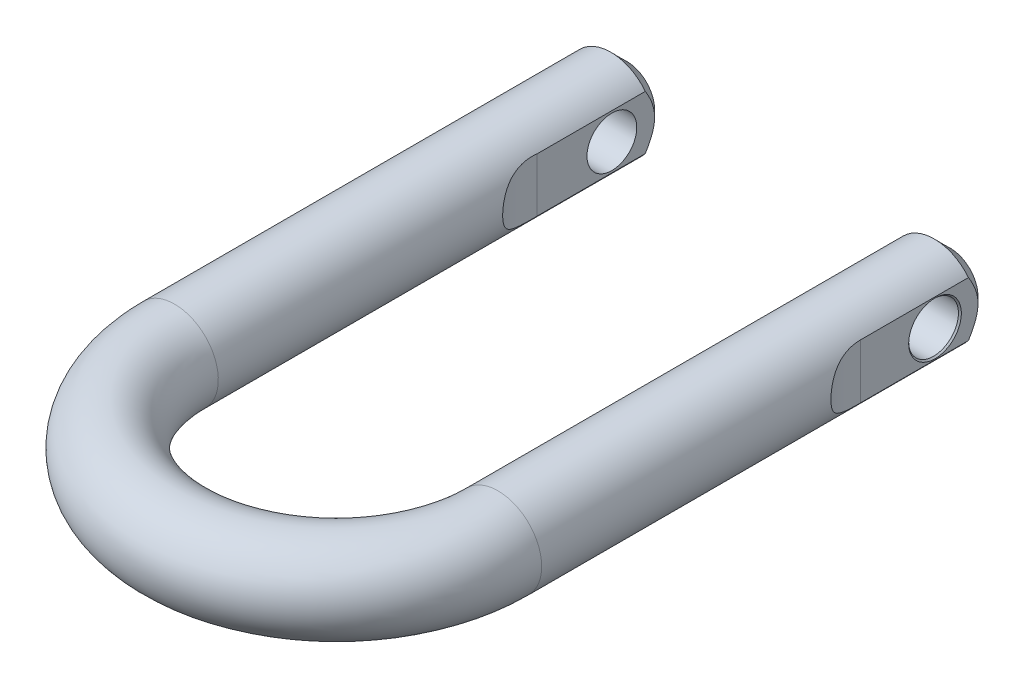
ISO-10303-21;
HEADER;
FILE_DESCRIPTION(('STEP AP214'),'2;1');
FILE_NAME('part.step','',(''),(''),'','','');
FILE_SCHEMA(('AUTOMOTIVE_DESIGN { 1 0 10303 214 1 1 1 1 }'));
ENDSEC;
DATA;
#1=APPLICATION_CONTEXT('core data for automotive mechanical design processes');
#2=APPLICATION_PROTOCOL_DEFINITION('international standard','automotive_design',2000,#1);
#3=PRODUCT_CONTEXT('',#1,'mechanical');
#4=PRODUCT('Part','Part','',(#3));
#5=PRODUCT_RELATED_PRODUCT_CATEGORY('part','',(#4));
#6=PRODUCT_DEFINITION_FORMATION('','',#4);
#7=PRODUCT_DEFINITION_CONTEXT('part definition',#1,'design');
#8=PRODUCT_DEFINITION('design','',#6,#7);
#9=PRODUCT_DEFINITION_SHAPE('','',#8);
#10=(LENGTH_UNIT() NAMED_UNIT(*) SI_UNIT(.MILLI.,.METRE.));
#11=(NAMED_UNIT(*) PLANE_ANGLE_UNIT() SI_UNIT($,.RADIAN.));
#12=(NAMED_UNIT(*) SI_UNIT($,.STERADIAN.) SOLID_ANGLE_UNIT());
#13=UNCERTAINTY_MEASURE_WITH_UNIT(LENGTH_MEASURE(1.E-05),#10,'distance_accuracy_value','');
#14=(GEOMETRIC_REPRESENTATION_CONTEXT(3) GLOBAL_UNCERTAINTY_ASSIGNED_CONTEXT((#13)) GLOBAL_UNIT_ASSIGNED_CONTEXT((#10,
#11,#12)) REPRESENTATION_CONTEXT('',''));
#15=CARTESIAN_POINT('',(0.,0.,0.));
#16=DIRECTION('',(0.,0.,1.));
#17=DIRECTION('',(1.,0.,0.));
#18=AXIS2_PLACEMENT_3D('',#15,#16,#17);
#19=CARTESIAN_POINT('',(59.0296,0.,0.));
#20=DIRECTION('',(1.,0.,0.));
#21=DIRECTION('',(0.,0.,1.));
#22=AXIS2_PLACEMENT_3D('',#19,#20,#21);
#23=CONICAL_SURFACE('',#22,7.9375,0.785398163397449);
#24=CARTESIAN_POINT('',(58.5921,0.,0.));
#25=DIRECTION('',(1.,0.,0.));
#26=DIRECTION('',(0.,0.,1.));
#27=AXIS2_PLACEMENT_3D('',#24,#25,#26);
#28=CIRCLE('',#27,7.5);
#29=CARTESIAN_POINT('',(58.5921,0.,7.49999999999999));
#30=VERTEX_POINT('',#29);
#31=EDGE_CURVE('E139',#30,#30,#28,.F.);
#32=ORIENTED_EDGE('',*,*,#31,.T.);
#33=EDGE_LOOP('',(#32));
#34=FACE_BOUND('',#33,.T.);
#35=CARTESIAN_POINT('',(59.0296,0.,0.));
#36=DIRECTION('',(1.,0.,0.));
#37=DIRECTION('',(0.,0.,1.));
#38=AXIS2_PLACEMENT_3D('',#35,#36,#37);
#39=CIRCLE('',#38,7.9375);
#40=CARTESIAN_POINT('',(59.0296,0.,7.93749999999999));
#41=VERTEX_POINT('',#40);
#42=EDGE_CURVE('E138',#41,#41,#39,.T.);
#43=ORIENTED_EDGE('',*,*,#42,.T.);
#44=EDGE_LOOP('',(#43));
#45=FACE_BOUND('',#44,.T.);
#46=ADVANCED_FACE('F14',(#34,#45),#23,.F.);
#47=CARTESIAN_POINT('',(48.7426,0.,-14.83995));
#48=DIRECTION('',(0.,0.,1.));
#49=DIRECTION('',(0.,-1.,0.));
#50=AXIS2_PLACEMENT_3D('',#47,#48,#49);
#51=PLANE('',#50);
#52=CARTESIAN_POINT('',(48.7426,0.,-14.83995));
#53=DIRECTION('',(0.,0.,1.));
#54=DIRECTION('',(-1.,0.,0.));
#55=AXIS2_PLACEMENT_3D('',#52,#53,#54);
#56=CIRCLE('',#55,8.4074);
#57=CARTESIAN_POINT('',(40.3352,0.,-14.83995));
#58=VERTEX_POINT('',#57);
#59=EDGE_CURVE('E136',#58,#58,#56,.T.);
#60=ORIENTED_EDGE('',*,*,#59,.F.);
#61=EDGE_LOOP('',(#60));
#62=FACE_BOUND('',#61,.T.);
#63=ADVANCED_FACE('F240',(#62),#51,.F.);
#64=CARTESIAN_POINT('',(-48.7426,0.,-14.83995));
#65=DIRECTION('',(0.,0.,-1.));
#66=DIRECTION('',(1.,0.,0.));
#67=AXIS2_PLACEMENT_3D('',#64,#65,#66);
#68=PLANE('',#67);
#69=CARTESIAN_POINT('',(-48.7426,0.,-14.83995));
#70=DIRECTION('',(0.,0.,1.));
#71=DIRECTION('',(-1.,0.,0.));
#72=AXIS2_PLACEMENT_3D('',#69,#70,#71);
#73=CIRCLE('',#72,8.4074);
#74=CARTESIAN_POINT('',(-57.15,0.,-14.83995));
#75=VERTEX_POINT('',#74);
#76=EDGE_CURVE('E438',#75,#75,#73,.T.);
#77=ORIENTED_EDGE('',*,*,#76,.F.);
#78=EDGE_LOOP('',(#77));
#79=FACE_BOUND('',#78,.T.);
#80=ADVANCED_FACE('F237',(#79),#68,.T.);
#81=CARTESIAN_POINT('',(-59.0296,0.,0.));
#82=DIRECTION('',(-1.,0.,0.));
#83=DIRECTION('',(0.,0.,-1.));
#84=AXIS2_PLACEMENT_3D('',#81,#82,#83);
#85=CONICAL_SURFACE('',#84,7.9375,0.785398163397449);
#86=CARTESIAN_POINT('',(-58.5921,0.,0.));
#87=DIRECTION('',(-1.,0.,0.));
#88=DIRECTION('',(0.,0.,-1.));
#89=AXIS2_PLACEMENT_3D('',#86,#87,#88);
#90=CIRCLE('',#89,7.5);
#91=CARTESIAN_POINT('',(-58.5921,0.,-7.49999999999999));
#92=VERTEX_POINT('',#91);
#93=EDGE_CURVE('E271',#92,#92,#90,.F.);
#94=ORIENTED_EDGE('',*,*,#93,.T.);
#95=EDGE_LOOP('',(#94));
#96=FACE_BOUND('',#95,.T.);
#97=CARTESIAN_POINT('',(-59.0296,0.,0.));
#98=DIRECTION('',(-1.,0.,0.));
#99=DIRECTION('',(0.,0.,-1.));
#100=AXIS2_PLACEMENT_3D('',#97,#98,#99);
#101=CIRCLE('',#100,7.9375);
#102=CARTESIAN_POINT('',(-59.0296,0.,-7.93749999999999));
#103=VERTEX_POINT('',#102);
#104=EDGE_CURVE('E116',#103,#103,#101,.T.);
#105=ORIENTED_EDGE('',*,*,#104,.T.);
#106=EDGE_LOOP('',(#105));
#107=FACE_BOUND('',#106,.T.);
#108=ADVANCED_FACE('F233',(#96,#107),#85,.F.);
#109=CARTESIAN_POINT('',(84.4296,25.4,22.49805));
#110=DIRECTION('',(0.,-1.,0.));
#111=DIRECTION('',(1.,0.,0.));
#112=AXIS2_PLACEMENT_3D('',#109,#110,#111);
#113=CYLINDRICAL_SURFACE('',#112,25.4);
#114=DIRECTION('',(0.,-1.,0.));
#115=VECTOR('',#114,1.);
#116=CARTESIAN_POINT('',(59.0296,25.4,22.49805));
#117=LINE('',#116,#115);
#118=CARTESIAN_POINT('',(59.0296,-8.22337503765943,22.49805));
#119=VERTEX_POINT('',#118);
#120=CARTESIAN_POINT('',(59.0296,8.22337503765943,22.49805));
#121=VERTEX_POINT('',#120);
#122=EDGE_CURVE('E137',#119,#121,#117,.F.);
#123=ORIENTED_EDGE('',*,*,#122,.T.);
#124=CARTESIAN_POINT('',(59.0296,-8.22337503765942,22.49805));
#125=CARTESIAN_POINT('',(59.0295964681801,-8.22336756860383,22.7016537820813));
#126=CARTESIAN_POINT('',(59.0320480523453,-8.22031233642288,22.9052572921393));
#127=CARTESIAN_POINT('',(59.0418354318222,-8.20805265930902,23.3121642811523));
#128=CARTESIAN_POINT('',(59.0491712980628,-8.1988481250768,23.5154677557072));
#129=CARTESIAN_POINT('',(59.0687103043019,-8.17422470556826,23.9216581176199));
#130=CARTESIAN_POINT('',(59.0809179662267,-8.15880004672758,24.124544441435));
#131=CARTESIAN_POINT('',(59.1101429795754,-8.12162950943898,24.5293807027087));
#132=CARTESIAN_POINT('',(59.1271604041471,-8.09988353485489,24.7313306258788));
#133=CARTESIAN_POINT('',(59.185664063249,-8.02451646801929,25.338831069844));
#134=CARTESIAN_POINT('',(59.2344321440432,-7.96097243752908,25.7425280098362));
#135=CARTESIAN_POINT('',(59.3502878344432,-7.80593343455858,26.5416896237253));
#136=CARTESIAN_POINT('',(59.4173674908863,-7.71445059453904,26.9371577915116));
#137=CARTESIAN_POINT('',(59.5523510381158,-7.52370289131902,27.6342553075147));
#138=CARTESIAN_POINT('',(59.6170905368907,-7.43015935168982,27.938067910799));
#139=CARTESIAN_POINT('',(59.7559004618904,-7.22281540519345,28.5364953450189));
#140=CARTESIAN_POINT('',(59.8299689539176,-7.10901919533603,28.8311120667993));
#141=CARTESIAN_POINT('',(59.9857406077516,-6.8599967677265,29.4079500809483));
#142=CARTESIAN_POINT('',(60.0674194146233,-6.72483801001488,29.6902069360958));
#143=CARTESIAN_POINT('',(60.2366804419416,-6.43125842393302,30.2404921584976));
#144=CARTESIAN_POINT('',(60.3242607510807,-6.27284510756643,30.5085250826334));
#145=CARTESIAN_POINT('',(60.4794557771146,-5.97600882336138,30.9592355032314));
#146=CARTESIAN_POINT('',(60.5462963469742,-5.84320614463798,31.1458915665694));
#147=CARTESIAN_POINT('',(60.6806054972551,-5.56366273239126,31.5081860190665));
#148=CARTESIAN_POINT('',(60.748073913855,-5.41692554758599,31.6838271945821));
#149=CARTESIAN_POINT('',(60.8822022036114,-5.10924960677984,32.0223970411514));
#150=CARTESIAN_POINT('',(60.948862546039,-4.94831959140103,32.1853334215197));
#151=CARTESIAN_POINT('',(61.079774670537,-4.61226373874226,32.4967613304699));
#152=CARTESIAN_POINT('',(61.1440268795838,-4.43714043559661,32.6452554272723));
#153=CARTESIAN_POINT('',(61.3081708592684,-3.9562433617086,33.0157817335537));
#154=CARTESIAN_POINT('',(61.404632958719,-3.63842599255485,33.2242520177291));
#155=CARTESIAN_POINT('',(61.5346338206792,-3.13689898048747,33.4976323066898));
#156=CARTESIAN_POINT('',(61.5755306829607,-2.96552429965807,33.5822280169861));
#157=CARTESIAN_POINT('',(61.651448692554,-2.61532318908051,33.7374120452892));
#158=CARTESIAN_POINT('',(61.686472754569,-2.43650051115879,33.8080073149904));
#159=CARTESIAN_POINT('',(61.7492534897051,-2.07517973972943,33.9333786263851));
#160=CARTESIAN_POINT('',(61.7771093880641,-1.89277426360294,33.9883718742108));
#161=CARTESIAN_POINT('',(61.8254585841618,-1.52309374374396,34.0831968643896));
#162=CARTESIAN_POINT('',(61.8459519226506,-1.33581872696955,34.1230286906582));
#163=CARTESIAN_POINT('',(61.87898110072,-0.957971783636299,34.1869715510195));
#164=CARTESIAN_POINT('',(61.8915196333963,-0.767400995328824,34.211087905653));
#165=CARTESIAN_POINT('',(61.9082784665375,-0.384549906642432,34.2432793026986));
#166=CARTESIAN_POINT('',(61.9124993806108,-0.192269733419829,34.2513555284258));
#167=CARTESIAN_POINT('',(61.9125005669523,0.17599235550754,34.2513568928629));
#168=CARTESIAN_POINT('',(61.908965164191,0.351975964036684,34.2445914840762));
#169=CARTESIAN_POINT('',(61.8949139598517,0.702629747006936,34.2176130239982));
#170=CARTESIAN_POINT('',(61.8843981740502,0.877299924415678,34.1974000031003));
#171=CARTESIAN_POINT('',(61.8566482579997,1.22403112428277,34.1437683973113));
#172=CARTESIAN_POINT('',(61.8394149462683,1.39609246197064,34.1103514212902));
#173=CARTESIAN_POINT('',(61.7986475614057,1.73645389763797,34.0306988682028));
#174=CARTESIAN_POINT('',(61.7751133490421,1.90475391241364,33.9844630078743));
#175=CARTESIAN_POINT('',(61.7223863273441,2.23593806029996,33.8798713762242));
#176=CARTESIAN_POINT('',(61.6932145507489,2.39883976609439,33.821560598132));
#177=CARTESIAN_POINT('',(61.6298007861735,2.71900769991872,33.693329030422));
#178=CARTESIAN_POINT('',(61.5955570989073,2.87627201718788,33.6234043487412));
#179=CARTESIAN_POINT('',(61.4862805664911,3.33838864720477,33.397229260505));
#180=CARTESIAN_POINT('',(61.4046644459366,3.63379258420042,33.2245047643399));
#181=CARTESIAN_POINT('',(61.2211907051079,4.22327185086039,32.8219692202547));
#182=CARTESIAN_POINT('',(61.1181209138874,4.51419394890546,32.5881523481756));
#183=CARTESIAN_POINT('',(60.9057951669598,5.05850041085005,32.0827076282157));
#184=CARTESIAN_POINT('',(60.7965357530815,5.31186349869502,31.8110585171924));
#185=CARTESIAN_POINT('',(60.6031548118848,5.72831891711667,31.3024271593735));
#186=CARTESIAN_POINT('',(60.5189331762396,5.89887114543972,31.0714868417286));
#187=CARTESIAN_POINT('',(60.3531804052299,6.2187745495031,30.594332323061));
#188=CARTESIAN_POINT('',(60.2716504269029,6.36811669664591,30.3481116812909));
#189=CARTESIAN_POINT('',(60.1131665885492,6.64697472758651,29.8425332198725));
#190=CARTESIAN_POINT('',(60.0362239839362,6.77644298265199,29.5831457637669));
#191=CARTESIAN_POINT('',(59.8887294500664,7.01640044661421,29.0540507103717));
#192=CARTESIAN_POINT('',(59.8181773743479,7.12689009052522,28.784343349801));
#193=CARTESIAN_POINT('',(59.6625786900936,7.36387427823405,28.1456552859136));
#194=CARTESIAN_POINT('',(59.5804816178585,7.48353010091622,27.7734075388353));
#195=CARTESIAN_POINT('',(59.431986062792,7.69414462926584,27.0177563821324));
#196=CARTESIAN_POINT('',(59.3655943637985,7.78509093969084,26.6343482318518));
#197=CARTESIAN_POINT('',(59.2500353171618,7.94036630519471,25.8599943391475));
#198=CARTESIAN_POINT('',(59.2008544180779,8.00471630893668,25.4690547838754));
#199=CARTESIAN_POINT('',(59.1205977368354,8.1084975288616,24.682240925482));
#200=CARTESIAN_POINT('',(59.0895128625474,8.14794125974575,24.286369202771));
#201=CARTESIAN_POINT('',(59.0550240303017,8.1914933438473,23.6576739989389));
#202=CARTESIAN_POINT('',(59.0454825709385,8.20347754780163,23.4256854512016));
#203=CARTESIAN_POINT('',(59.0327762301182,8.21940263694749,22.9618207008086));
#204=CARTESIAN_POINT('',(59.029595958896,8.22336293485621,22.7299455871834));
#205=CARTESIAN_POINT('',(59.0296,8.22337503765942,22.49805));
#206=B_SPLINE_CURVE_WITH_KNOTS('',3,(#124,#125,#126,#127,#128,#129,#130,#131,#132,#133,#134,
#135,#136,#137,#138,#139,#140,#141,#142,#143,#144,#145,#146,#147,#148,#149,#150,#151,#152,#153,
#154,#155,#156,#157,#158,#159,#160,#161,#162,#163,#164,#165,#166,#167,#168,#169,#170,#171,#172,
#173,#174,#175,#176,#177,#178,#179,#180,#181,#182,#183,#184,#185,#186,#187,#188,#189,#190,#191,
#192,#193,#194,#195,#196,#197,#198,#199,#200,#201,#202,#203,#204,#205),.UNSPECIFIED.,.F.,.F.,(4,
2,2,2,2,2,2,2,2,2,2,2,2,2,2,2,2,2,2,2,2,2,2,2,2,2,2,2,2,2,2,2,2,2,2,2,2,2,2,2,4),(0.,
0.61077262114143,1.22155411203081,1.83290384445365,2.44426287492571,3.67749443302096,
4.91019121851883,5.8826187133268,6.85484492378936,7.82406015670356,8.79296298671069,
9.50826502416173,10.2233853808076,10.9380683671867,11.6526240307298,12.8232855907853,
13.4090341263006,13.9944910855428,14.5713453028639,15.1481963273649,15.7248519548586,
16.301465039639,16.8292625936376,17.3570589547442,17.8847910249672,18.4125347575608,
18.9383463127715,19.4643344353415,20.5155915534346,21.6731225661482,22.8313068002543,
23.7277165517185,24.6245067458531,25.5234136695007,26.4222999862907,27.6192046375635,
28.8166253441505,30.0131010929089,31.2089751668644,31.9062534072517,32.6018426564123),.UNSPECIFIED.);
#207=EDGE_CURVE('E181',#119,#121,#206,.T.);
#208=ORIENTED_EDGE('',*,*,#207,.F.);
#209=EDGE_LOOP('',(#123,#208));
#210=FACE_BOUND('',#209,.T.);
#211=ADVANCED_FACE('F228',(#210),#113,.F.);
#212=CARTESIAN_POINT('',(59.0296,25.4,-35.3090993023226));
#213=DIRECTION('',(-1.,0.,0.));
#214=DIRECTION('',(0.,0.,-1.));
#215=AXIS2_PLACEMENT_3D('',#212,#213,#214);
#216=PLANE('',#215);
#217=ORIENTED_EDGE('',*,*,#42,.F.);
#218=EDGE_LOOP('',(#217));
#219=FACE_BOUND('',#218,.T.);
#220=DIRECTION('',(0.,0.,-1.));
#221=VECTOR('',#220,1.);
#222=CARTESIAN_POINT('',(59.0296,-8.22337503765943,121.44375));
#223=LINE('',#222,#221);
#224=CARTESIAN_POINT('',(59.0296,-8.22337503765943,-10.07745));
#225=VERTEX_POINT('',#224);
#226=EDGE_CURVE('E105',#225,#119,#223,.F.);
#227=ORIENTED_EDGE('',*,*,#226,.F.);
#228=CARTESIAN_POINT('',(59.0296,8.22337503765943,-10.07745));
#229=CARTESIAN_POINT('',(59.0296,8.02526383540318,-10.2011338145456));
#230=CARTESIAN_POINT('',(59.0296,7.82593146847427,-10.3228883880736));
#231=CARTESIAN_POINT('',(59.0296,7.42454033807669,-10.5619235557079));
#232=CARTESIAN_POINT('',(59.0296,7.22248093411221,-10.679203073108));
#233=CARTESIAN_POINT('',(59.0296,6.81459284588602,-10.9090938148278));
#234=CARTESIAN_POINT('',(59.0296,6.60875190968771,-11.0216834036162));
#235=CARTESIAN_POINT('',(59.0296,6.19391827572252,-11.2408511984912));
#236=CARTESIAN_POINT('',(59.0296,5.98492577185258,-11.3474297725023));
#237=CARTESIAN_POINT('',(59.0296,5.34349051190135,-11.6614158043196));
#238=CARTESIAN_POINT('',(59.0296,4.90558714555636,-11.857905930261));
#239=CARTESIAN_POINT('',(59.0296,4.01485423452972,-12.2121703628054));
#240=CARTESIAN_POINT('',(59.0296,3.56205090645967,-12.3700089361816));
#241=CARTESIAN_POINT('',(59.0296,2.80100013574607,-12.5897266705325));
#242=CARTESIAN_POINT('',(59.0296,2.49689248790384,-12.6659160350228));
#243=CARTESIAN_POINT('',(59.0296,1.88345085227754,-12.7936494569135));
#244=CARTESIAN_POINT('',(59.0296,1.57411680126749,-12.8451932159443));
#245=CARTESIAN_POINT('',(59.0296,0.955218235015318,-12.9206138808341));
#246=CARTESIAN_POINT('',(59.0296,0.645687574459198,-12.9447648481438));
#247=CARTESIAN_POINT('',(59.0296,0.0257101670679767,-12.9649831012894));
#248=CARTESIAN_POINT('',(59.0296,-0.284736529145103,-12.9610519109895));
#249=CARTESIAN_POINT('',(59.0296,-0.903850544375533,-12.9253435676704));
#250=CARTESIAN_POINT('',(59.0296,-1.21251863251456,-12.8935795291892));
#251=CARTESIAN_POINT('',(59.0296,-1.82601712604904,-12.8039529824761));
#252=CARTESIAN_POINT('',(59.0296,-2.13084710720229,-12.7460876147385));
#253=CARTESIAN_POINT('',(59.0296,-2.73799233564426,-12.6063546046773));
#254=CARTESIAN_POINT('',(59.0296,-3.04025470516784,-12.5242601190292));
#255=CARTESIAN_POINT('',(59.0296,-3.63837827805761,-12.3395912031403));
#256=CARTESIAN_POINT('',(59.0296,-3.9342394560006,-12.2370166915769));
#257=CARTESIAN_POINT('',(59.0296,-4.580830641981,-11.9912817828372));
#258=CARTESIAN_POINT('',(59.0296,-4.93003148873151,-11.8441220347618));
#259=CARTESIAN_POINT('',(59.0296,-5.61931704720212,-11.529630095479));
#260=CARTESIAN_POINT('',(59.0296,-5.95939715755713,-11.3622879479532));
#261=CARTESIAN_POINT('',(59.0296,-6.62430275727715,-11.0152201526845));
#262=CARTESIAN_POINT('',(59.0296,-6.94929797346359,-10.8358176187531));
#263=CARTESIAN_POINT('',(59.0296,-7.43120304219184,-10.5576686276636));
#264=CARTESIAN_POINT('',(59.0296,-7.59079347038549,-10.463516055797));
#265=CARTESIAN_POINT('',(59.0296,-7.90830253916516,-10.2724678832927));
#266=CARTESIAN_POINT('',(59.0296,-8.06622135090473,-10.1755725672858));
#267=CARTESIAN_POINT('',(59.0296,-8.22337503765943,-10.07745));
#268=B_SPLINE_CURVE_WITH_KNOTS('',3,(#228,#229,#230,#231,#232,#233,#234,#235,#236,#237,#238,
#239,#240,#241,#242,#243,#244,#245,#246,#247,#248,#249,#250,#251,#252,#253,#254,#255,#256,#257,
#258,#259,#260,#261,#262,#263,#264,#265,#266,#267),.UNSPECIFIED.,.F.,.F.,(4,2,2,2,2,2,2,2,2,2,2,
2,2,2,2,2,2,2,2,4),(0.,0.700659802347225,1.40148713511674,2.10525296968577,2.80897568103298,
4.24749394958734,5.68360386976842,6.6232597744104,7.5629270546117,8.49310778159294,
9.42323803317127,10.3529302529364,11.2827243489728,12.2215157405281,13.1603108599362,
14.2963089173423,15.4328696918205,16.5461943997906,17.1020540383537,17.6578562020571),.UNSPECIFIED.);
#269=CARTESIAN_POINT('',(59.0296,8.22337503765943,-10.07745));
#270=VERTEX_POINT('',#269);
#271=EDGE_CURVE('E220',#270,#225,#268,.T.);
#272=ORIENTED_EDGE('',*,*,#271,.F.);
#273=DIRECTION('',(0.,0.,-1.));
#274=VECTOR('',#273,1.);
#275=CARTESIAN_POINT('',(59.0296,8.22337503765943,121.44375));
#276=LINE('',#275,#274);
#277=EDGE_CURVE('E131',#121,#270,#276,.T.);
#278=ORIENTED_EDGE('',*,*,#277,.F.);
#279=ORIENTED_EDGE('',*,*,#122,.F.);
#280=EDGE_LOOP('',(#227,#272,#278,#279));
#281=FACE_BOUND('',#280,.T.);
#282=ADVANCED_FACE('F225',(#219,#281),#216,.F.);
#283=CARTESIAN_POINT('',(48.7426,0.,-10.07745));
#284=DIRECTION('',(0.,0.,1.));
#285=DIRECTION('',(-1.,0.,0.));
#286=AXIS2_PLACEMENT_3D('',#283,#284,#285);
#287=CONICAL_SURFACE('',#286,13.1699,0.78539816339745);
#288=ORIENTED_EDGE('',*,*,#59,.T.);
#289=EDGE_LOOP('',(#288));
#290=FACE_BOUND('',#289,.T.);
#291=CARTESIAN_POINT('',(38.3794,-8.12713675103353,-10.07745));
#292=CARTESIAN_POINT('',(38.3794,-7.93111417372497,-10.1983981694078));
#293=CARTESIAN_POINT('',(38.3794,-7.73388385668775,-10.3174155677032));
#294=CARTESIAN_POINT('',(38.3794,-7.33673633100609,-10.5509844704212));
#295=CARTESIAN_POINT('',(38.3794,-7.13681849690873,-10.665534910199));
#296=CARTESIAN_POINT('',(38.3794,-6.73330326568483,-10.8899603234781));
#297=CARTESIAN_POINT('',(38.3794,-6.52969426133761,-10.9998145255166));
#298=CARTESIAN_POINT('',(38.3794,-6.11939103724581,-11.2135548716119));
#299=CARTESIAN_POINT('',(38.3794,-5.91269700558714,-11.3174413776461));
#300=CARTESIAN_POINT('',(38.3794,-5.27887907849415,-11.6230960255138));
#301=CARTESIAN_POINT('',(38.3794,-4.84644365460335,-11.8140857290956));
#302=CARTESIAN_POINT('',(38.3794,-3.96716928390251,-12.1581049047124));
#303=CARTESIAN_POINT('',(38.3794,-3.52035454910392,-12.3111947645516));
#304=CARTESIAN_POINT('',(38.3794,-2.76395291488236,-12.525823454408));
#305=CARTESIAN_POINT('',(38.3794,-2.45820837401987,-12.6008732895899));
#306=CARTESIAN_POINT('',(38.3794,-1.8415787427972,-12.7261195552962));
#307=CARTESIAN_POINT('',(38.3794,-1.53069360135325,-12.7763157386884));
#308=CARTESIAN_POINT('',(38.3794,-0.908724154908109,-12.8489231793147));
#309=CARTESIAN_POINT('',(38.3794,-0.597671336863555,-12.871600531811));
#310=CARTESIAN_POINT('',(38.3794,0.0252108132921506,-12.888795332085));
#311=CARTESIAN_POINT('',(38.3794,0.337040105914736,-12.8833141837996));
#312=CARTESIAN_POINT('',(38.3794,0.958694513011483,-12.8445231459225));
#313=CARTESIAN_POINT('',(38.3794,1.26852097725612,-12.8112345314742));
#314=CARTESIAN_POINT('',(38.3794,1.88423735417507,-12.718648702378));
#315=CARTESIAN_POINT('',(38.3794,2.19012683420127,-12.6593486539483));
#316=CARTESIAN_POINT('',(38.3794,2.79921745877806,-12.5168803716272));
#317=CARTESIAN_POINT('',(38.3794,3.10236739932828,-12.433495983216));
#318=CARTESIAN_POINT('',(38.3794,3.70224539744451,-12.2463830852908));
#319=CARTESIAN_POINT('',(38.3794,3.99897343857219,-12.1426545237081));
#320=CARTESIAN_POINT('',(38.3794,4.63110074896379,-11.9007632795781));
#321=CARTESIAN_POINT('',(38.3794,4.96540460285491,-11.7597571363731));
#322=CARTESIAN_POINT('',(38.3794,5.62568955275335,-11.4593132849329));
#323=CARTESIAN_POINT('',(38.3794,5.95166727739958,-11.2998682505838));
#324=CARTESIAN_POINT('',(38.3794,6.58975037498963,-10.9694156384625));
#325=CARTESIAN_POINT('',(38.3794,6.90200191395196,-10.7986886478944));
#326=CARTESIAN_POINT('',(38.3794,7.36522804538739,-10.5341091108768));
#327=CARTESIAN_POINT('',(38.3794,7.51868555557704,-10.444558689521));
#328=CARTESIAN_POINT('',(38.3794,7.82404597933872,-10.2628756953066));
#329=CARTESIAN_POINT('',(38.3794,7.9759490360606,-10.1707433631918));
#330=CARTESIAN_POINT('',(38.3794,8.12713675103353,-10.07745));
#331=B_SPLINE_CURVE_WITH_KNOTS('',3,(#291,#292,#293,#294,#295,#296,#297,#298,#299,#300,#301,
#302,#303,#304,#305,#306,#307,#308,#309,#310,#311,#312,#313,#314,#315,#316,#317,#318,#319,#320,
#321,#322,#323,#324,#325,#326,#327,#328,#329,#330),.UNSPECIFIED.,.F.,.F.,(4,2,2,2,2,2,2,2,2,2,2,
2,2,2,2,2,2,2,2,4),(0.,0.691007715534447,1.38217913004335,2.07614447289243,2.77006767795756,
4.18691184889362,5.601483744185,6.54507035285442,7.48866634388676,8.42306354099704,
9.35741415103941,10.2910505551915,11.2247886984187,12.1671822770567,13.1095782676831,
14.1973456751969,15.2855467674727,16.3528661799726,16.8858715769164,17.4188274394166),.UNSPECIFIED.);
#332=CARTESIAN_POINT('',(38.3794,-8.12713675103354,-10.07745));
#333=VERTEX_POINT('',#332);
#334=CARTESIAN_POINT('',(38.3794,8.12713675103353,-10.07745));
#335=VERTEX_POINT('',#334);
#336=EDGE_CURVE('E124',#333,#335,#331,.T.);
#337=ORIENTED_EDGE('',*,*,#336,.T.);
#338=CARTESIAN_POINT('',(48.7426,0.,-10.07745));
#339=DIRECTION('',(0.,0.,-1.));
#340=DIRECTION('',(1.,0.,0.));
#341=AXIS2_PLACEMENT_3D('',#338,#339,#340);
#342=CIRCLE('',#341,13.1699);
#343=EDGE_CURVE('E127',#270,#335,#342,.F.);
#344=ORIENTED_EDGE('',*,*,#343,.F.);
#345=ORIENTED_EDGE('',*,*,#271,.T.);
#346=CARTESIAN_POINT('',(48.7426,0.,-10.07745));
#347=DIRECTION('',(0.,0.,-1.));
#348=DIRECTION('',(1.,0.,0.));
#349=AXIS2_PLACEMENT_3D('',#346,#347,#348);
#350=CIRCLE('',#349,13.1699);
#351=EDGE_CURVE('E102',#333,#225,#350,.F.);
#352=ORIENTED_EDGE('',*,*,#351,.F.);
#353=EDGE_LOOP('',(#337,#344,#345,#352));
#354=FACE_BOUND('',#353,.T.);
#355=ADVANCED_FACE('F202',(#290,#354),#287,.T.);
#356=CARTESIAN_POINT('',(38.3794,25.4,-35.6582064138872));
#357=DIRECTION('',(1.,0.,0.));
#358=DIRECTION('',(0.,1.,0.));
#359=AXIS2_PLACEMENT_3D('',#356,#357,#358);
#360=PLANE('',#359);
#361=CARTESIAN_POINT('',(38.3794,0.,0.));
#362=DIRECTION('',(1.,0.,0.));
#363=DIRECTION('',(0.,1.,0.));
#364=AXIS2_PLACEMENT_3D('',#361,#362,#363);
#365=CIRCLE('',#364,7.5);
#366=CARTESIAN_POINT('',(38.3794,7.5,0.));
#367=VERTEX_POINT('',#366);
#368=EDGE_CURVE('E272',#367,#367,#365,.T.);
#369=ORIENTED_EDGE('',*,*,#368,.T.);
#370=EDGE_LOOP('',(#369));
#371=FACE_BOUND('',#370,.T.);
#372=DIRECTION('',(0.,0.,-1.));
#373=VECTOR('',#372,1.);
#374=CARTESIAN_POINT('',(38.3794,-8.12713675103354,121.44375));
#375=LINE('',#374,#373);
#376=CARTESIAN_POINT('',(38.3794,-8.12713675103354,22.49805));
#377=VERTEX_POINT('',#376);
#378=EDGE_CURVE('E120',#377,#333,#375,.T.);
#379=ORIENTED_EDGE('',*,*,#378,.F.);
#380=DIRECTION('',(0.,1.,0.));
#381=VECTOR('',#380,1.);
#382=CARTESIAN_POINT('',(38.3794,25.4,22.49805));
#383=LINE('',#382,#381);
#384=CARTESIAN_POINT('',(38.3794,8.12713675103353,22.49805));
#385=VERTEX_POINT('',#384);
#386=EDGE_CURVE('E134',#385,#377,#383,.F.);
#387=ORIENTED_EDGE('',*,*,#386,.F.);
#388=DIRECTION('',(0.,0.,-1.));
#389=VECTOR('',#388,1.);
#390=CARTESIAN_POINT('',(38.3794,8.12713675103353,121.44375));
#391=LINE('',#390,#389);
#392=EDGE_CURVE('E130',#335,#385,#391,.F.);
#393=ORIENTED_EDGE('',*,*,#392,.F.);
#394=ORIENTED_EDGE('',*,*,#336,.F.);
#395=EDGE_LOOP('',(#379,#387,#393,#394));
#396=FACE_BOUND('',#395,.T.);
#397=ADVANCED_FACE('F197',(#371,#396),#360,.F.);
#398=CARTESIAN_POINT('',(13.0251612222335,25.4,24.02205));
#399=DIRECTION('',(0.,-1.,0.));
#400=DIRECTION('',(1.,0.,0.));
#401=AXIS2_PLACEMENT_3D('',#398,#399,#400);
#402=CYLINDRICAL_SURFACE('',#401,25.4);
#403=CARTESIAN_POINT('',(38.3794,8.12713675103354,22.49805));
#404=CARTESIAN_POINT('',(38.3946115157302,8.14650683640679,22.7510065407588));
#405=CARTESIAN_POINT('',(38.4060443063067,8.16100064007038,23.0045356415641));
#406=CARTESIAN_POINT('',(38.4213274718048,8.18033338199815,23.5127176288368));
#407=CARTESIAN_POINT('',(38.4251620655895,8.18515222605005,23.7673717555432));
#408=CARTESIAN_POINT('',(38.4251598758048,8.18515319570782,24.4286471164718));
#409=CARTESIAN_POINT('',(38.415382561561,8.17287221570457,24.8353057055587));
#410=CARTESIAN_POINT('',(38.3764249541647,8.12340255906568,25.6463530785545));
#411=CARTESIAN_POINT('',(38.3472351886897,8.08620172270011,26.0507406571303));
#412=CARTESIAN_POINT('',(38.2699269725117,7.9858255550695,26.8549147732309));
#413=CARTESIAN_POINT('',(38.22178875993,7.92262310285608,27.2546960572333));
#414=CARTESIAN_POINT('',(38.1075412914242,7.76859197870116,28.0462210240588));
#415=CARTESIAN_POINT('',(38.0414382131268,7.67777280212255,28.4379674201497));
#416=CARTESIAN_POINT('',(37.9082257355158,7.48819255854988,29.1299097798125));
#417=CARTESIAN_POINT('',(37.8441749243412,7.39499558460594,29.4322262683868));
#418=CARTESIAN_POINT('',(37.7068230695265,7.18841438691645,30.0277889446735));
#419=CARTESIAN_POINT('',(37.6335218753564,7.0750298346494,30.3210349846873));
#420=CARTESIAN_POINT('',(37.4792507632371,6.82675271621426,30.8956115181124));
#421=CARTESIAN_POINT('',(37.3982939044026,6.6918965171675,31.1769611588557));
#422=CARTESIAN_POINT('',(37.2305220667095,6.39896950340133,31.7254687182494));
#423=CARTESIAN_POINT('',(37.1437089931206,6.24090621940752,31.9926312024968));
#424=CARTESIAN_POINT('',(36.9899571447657,5.94488474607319,32.4416228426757));
#425=CARTESIAN_POINT('',(36.9237874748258,5.81255065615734,32.6274339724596));
#426=CARTESIAN_POINT('',(36.7908304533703,5.53401234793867,32.9880898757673));
#427=CARTESIAN_POINT('',(36.7240432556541,5.38781150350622,33.1629372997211));
#428=CARTESIAN_POINT('',(36.5912879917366,5.08131016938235,33.4999420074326));
#429=CARTESIAN_POINT('',(36.5253193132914,4.92102104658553,33.6621093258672));
#430=CARTESIAN_POINT('',(36.3957729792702,4.5863275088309,33.9720630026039));
#431=CARTESIAN_POINT('',(36.3321948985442,4.41192562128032,34.1198519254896));
#432=CARTESIAN_POINT('',(36.1697895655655,3.93305270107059,34.4885976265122));
#433=CARTESIAN_POINT('',(36.0743634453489,3.61660902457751,34.6960511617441));
#434=CARTESIAN_POINT('',(35.945786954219,3.11729853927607,34.9680573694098));
#435=CARTESIAN_POINT('',(35.9053437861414,2.94669101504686,35.0522193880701));
#436=CARTESIAN_POINT('',(35.8302801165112,2.5980718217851,35.2065881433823));
#437=CARTESIAN_POINT('',(35.7956567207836,2.42006388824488,35.2768018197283));
#438=CARTESIAN_POINT('',(35.7336759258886,2.06078682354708,35.401335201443));
#439=CARTESIAN_POINT('',(35.706206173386,1.87962280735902,35.4559022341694));
#440=CARTESIAN_POINT('',(35.6585285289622,1.5124792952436,35.549993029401));
#441=CARTESIAN_POINT('',(35.638320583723,1.32649983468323,35.589516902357));
#442=CARTESIAN_POINT('',(35.6057514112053,0.951276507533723,35.652966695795));
#443=CARTESIAN_POINT('',(35.5933877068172,0.762033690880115,35.6768975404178));
#444=CARTESIAN_POINT('',(35.5768625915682,0.381857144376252,35.7088414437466));
#445=CARTESIAN_POINT('',(35.5727005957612,0.190923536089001,35.7168556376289));
#446=CARTESIAN_POINT('',(35.5726994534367,-0.175157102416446,35.716856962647));
#447=CARTESIAN_POINT('',(35.5762013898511,-0.350305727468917,35.7101129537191));
#448=CARTESIAN_POINT('',(35.5901194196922,-0.699295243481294,35.6832202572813));
#449=CARTESIAN_POINT('',(35.6005355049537,-0.873136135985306,35.6630715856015));
#450=CARTESIAN_POINT('',(35.6280216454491,-1.2182199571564,35.6096122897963));
#451=CARTESIAN_POINT('',(35.6450908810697,-1.38946320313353,35.5763032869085));
#452=CARTESIAN_POINT('',(35.6854688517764,-1.72820524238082,35.4969111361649));
#453=CARTESIAN_POINT('',(35.7087777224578,-1.8957039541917,35.4508277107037));
#454=CARTESIAN_POINT('',(35.7609975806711,-2.22530833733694,35.3465863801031));
#455=CARTESIAN_POINT('',(35.7898876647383,-2.38743156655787,35.2884734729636));
#456=CARTESIAN_POINT('',(35.8526865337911,-2.70606975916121,35.1606835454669));
#457=CARTESIAN_POINT('',(35.8865970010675,-2.86258282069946,35.0910026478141));
#458=CARTESIAN_POINT('',(35.9948056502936,-3.32249437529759,34.8656281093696));
#459=CARTESIAN_POINT('',(36.075618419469,-3.61649146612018,34.6935300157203));
#460=CARTESIAN_POINT('',(36.2572966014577,-4.20326293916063,34.2924429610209));
#461=CARTESIAN_POINT('',(36.3593644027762,-4.49289106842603,34.0594549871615));
#462=CARTESIAN_POINT('',(36.5696084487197,-5.03479345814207,33.5558518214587));
#463=CARTESIAN_POINT('',(36.6777880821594,-5.28704670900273,33.2852156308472));
#464=CARTESIAN_POINT('',(36.8692920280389,-5.7018046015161,32.7783918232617));
#465=CARTESIAN_POINT('',(36.9527187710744,-5.87171892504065,32.5482033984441));
#466=CARTESIAN_POINT('',(37.1168933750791,-6.19042472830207,32.0726217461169));
#467=CARTESIAN_POINT('',(37.1976400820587,-6.33920719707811,31.8272220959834));
#468=CARTESIAN_POINT('',(37.354589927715,-6.61702495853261,31.3233322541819));
#469=CARTESIAN_POINT('',(37.4307815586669,-6.74601142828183,31.0648117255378));
#470=CARTESIAN_POINT('',(37.5768159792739,-6.98506469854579,30.5375040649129));
#471=CARTESIAN_POINT('',(37.6466589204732,-7.09513195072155,30.2687171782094));
#472=CARTESIAN_POINT('',(37.8006631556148,-7.33118620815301,29.63223830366));
#473=CARTESIAN_POINT('',(37.8818954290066,-7.45035443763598,29.2612977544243));
#474=CARTESIAN_POINT('',(38.0287733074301,-7.66006133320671,28.5083288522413));
#475=CARTESIAN_POINT('',(38.0944121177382,-7.75058752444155,28.1262957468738));
#476=CARTESIAN_POINT('',(38.2085655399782,-7.90503513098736,27.354916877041));
#477=CARTESIAN_POINT('',(38.2571010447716,-7.96898902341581,26.9655806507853));
#478=CARTESIAN_POINT('',(38.3362150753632,-8.07202877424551,26.1820270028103));
#479=CARTESIAN_POINT('',(38.3668029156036,-8.11112753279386,25.7878122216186));
#480=CARTESIAN_POINT('',(38.4004872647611,-8.15397531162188,25.1644185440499));
#481=CARTESIAN_POINT('',(38.4097405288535,-8.16568274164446,24.9360688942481));
#482=CARTESIAN_POINT('',(38.4220745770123,-8.18126671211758,24.4791631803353));
#483=CARTESIAN_POINT('',(38.4251617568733,-8.18515136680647,24.2506075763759));
#484=CARTESIAN_POINT('',(38.4251606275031,-8.18515397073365,23.7678037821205));
#485=CARTESIAN_POINT('',(38.4213392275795,-8.18034991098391,23.5135551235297));
#486=CARTESIAN_POINT('',(38.4060823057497,-8.16104698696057,23.0053535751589));
#487=CARTESIAN_POINT('',(38.3946377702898,-8.14653664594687,22.7514013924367));
#488=CARTESIAN_POINT('',(38.3794,-8.12713675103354,22.49805));
#489=B_SPLINE_CURVE_WITH_KNOTS('',3,(#403,#404,#405,#406,#407,#408,#409,#410,#411,#412,#413,
#414,#415,#416,#417,#418,#419,#420,#421,#422,#423,#424,#425,#426,#427,#428,#429,#430,#431,#432,
#433,#434,#435,#436,#437,#438,#439,#440,#441,#442,#443,#444,#445,#446,#447,#448,#449,#450,#451,
#452,#453,#454,#455,#456,#457,#458,#459,#460,#461,#462,#463,#464,#465,#466,#467,#468,#469,#470,
#471,#472,#473,#474,#475,#476,#477,#478,#479,#480,#481,#482,#483,#484,#485,#486,#487,#488),
.UNSPECIFIED.,.F.,.F.,(4,2,2,2,2,2,2,2,2,2,2,2,2,2,2,2,2,2,2,2,2,2,2,2,2,2,2,2,2,2,2,2,2,2,2,2,
2,2,2,2,2,2,4),(0.,0.76232888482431,1.52623944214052,2.74583254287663,3.96602118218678,
5.18748577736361,6.40853087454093,7.37605348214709,8.34359183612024,9.30950854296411,
10.2751124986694,10.9870897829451,11.6988942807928,12.4101296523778,13.1212379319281,
14.2862041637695,14.8690901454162,15.4516853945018,16.0244876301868,16.5972856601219,
17.1699027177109,17.7424789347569,18.2677719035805,18.7930642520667,19.3182919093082,
19.8435309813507,20.3668397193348,20.8903242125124,21.9365794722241,23.0889147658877,
24.241895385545,25.1348074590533,26.0280991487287,26.923559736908,27.8189989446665,
29.011286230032,30.2040920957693,31.3954357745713,32.5861606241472,33.2724821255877,
33.9580913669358,34.7207593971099,35.4843308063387),.UNSPECIFIED.);
#490=EDGE_CURVE('E66',#385,#377,#489,.T.);
#491=ORIENTED_EDGE('',*,*,#490,.F.);
#492=ORIENTED_EDGE('',*,*,#386,.T.);
#493=EDGE_LOOP('',(#491,#492));
#494=FACE_BOUND('',#493,.T.);
#495=ADVANCED_FACE('F192',(#494),#402,.F.);
#496=CARTESIAN_POINT('',(-84.4296,25.4,22.49805));
#497=DIRECTION('',(0.,-1.,0.));
#498=DIRECTION('',(1.,0.,0.));
#499=AXIS2_PLACEMENT_3D('',#496,#497,#498);
#500=CYLINDRICAL_SURFACE('',#499,25.4);
#501=DIRECTION('',(0.,-1.,0.));
#502=VECTOR('',#501,1.);
#503=CARTESIAN_POINT('',(-59.0296,25.4,22.49805));
#504=LINE('',#503,#502);
#505=CARTESIAN_POINT('',(-59.0296,8.22337503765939,22.49805));
#506=VERTEX_POINT('',#505);
#507=CARTESIAN_POINT('',(-59.0296,-8.22337503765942,22.49805));
#508=VERTEX_POINT('',#507);
#509=EDGE_CURVE('E99',#506,#508,#504,.T.);
#510=ORIENTED_EDGE('',*,*,#509,.T.);
#511=CARTESIAN_POINT('',(-59.0296,8.22337503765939,22.49805));
#512=CARTESIAN_POINT('',(-59.0295964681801,8.22336756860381,22.7016537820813));
#513=CARTESIAN_POINT('',(-59.0320480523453,8.22031233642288,22.9052572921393));
#514=CARTESIAN_POINT('',(-59.0418354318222,8.20805265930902,23.3121642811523));
#515=CARTESIAN_POINT('',(-59.0491712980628,8.1988481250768,23.5154677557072));
#516=CARTESIAN_POINT('',(-59.0687103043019,8.17422470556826,23.9216581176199));
#517=CARTESIAN_POINT('',(-59.0809179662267,8.15880004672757,24.124544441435));
#518=CARTESIAN_POINT('',(-59.1101429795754,8.12162950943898,24.5293807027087));
#519=CARTESIAN_POINT('',(-59.1271604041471,8.09988353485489,24.7313306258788));
#520=CARTESIAN_POINT('',(-59.185664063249,8.0245164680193,25.3388310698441));
#521=CARTESIAN_POINT('',(-59.2344321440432,7.96097243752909,25.7425280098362));
#522=CARTESIAN_POINT('',(-59.3502878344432,7.80593343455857,26.5416896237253));
#523=CARTESIAN_POINT('',(-59.4173674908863,7.71445059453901,26.9371577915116));
#524=CARTESIAN_POINT('',(-59.5523510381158,7.52370289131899,27.6342553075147));
#525=CARTESIAN_POINT('',(-59.6170905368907,7.43015935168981,27.938067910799));
#526=CARTESIAN_POINT('',(-59.7559004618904,7.22281540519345,28.5364953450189));
#527=CARTESIAN_POINT('',(-59.8299689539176,7.10901919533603,28.8311120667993));
#528=CARTESIAN_POINT('',(-59.9857406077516,6.85999676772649,29.4079500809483));
#529=CARTESIAN_POINT('',(-60.0674194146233,6.72483801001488,29.6902069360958));
#530=CARTESIAN_POINT('',(-60.2366804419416,6.43125842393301,30.2404921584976));
#531=CARTESIAN_POINT('',(-60.3242607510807,6.27284510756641,30.5085250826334));
#532=CARTESIAN_POINT('',(-60.4794557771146,5.97600882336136,30.9592355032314));
#533=CARTESIAN_POINT('',(-60.5462963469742,5.84320614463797,31.1458915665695));
#534=CARTESIAN_POINT('',(-60.6806054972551,5.56366273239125,31.5081860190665));
#535=CARTESIAN_POINT('',(-60.748073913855,5.41692554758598,31.6838271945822));
#536=CARTESIAN_POINT('',(-60.8822022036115,5.10924960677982,32.0223970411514));
#537=CARTESIAN_POINT('',(-60.948862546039,4.94831959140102,32.1853334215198));
#538=CARTESIAN_POINT('',(-61.079774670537,4.61226373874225,32.4967613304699));
#539=CARTESIAN_POINT('',(-61.1440268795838,4.4371404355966,32.6452554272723));
#540=CARTESIAN_POINT('',(-61.3081708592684,3.95624336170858,33.0157817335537));
#541=CARTESIAN_POINT('',(-61.404632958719,3.63842599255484,33.2242520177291));
#542=CARTESIAN_POINT('',(-61.5346338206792,3.13689898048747,33.4976323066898));
#543=CARTESIAN_POINT('',(-61.5755306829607,2.96552429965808,33.5822280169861));
#544=CARTESIAN_POINT('',(-61.651448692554,2.61532318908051,33.7374120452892));
#545=CARTESIAN_POINT('',(-61.686472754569,2.43650051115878,33.8080073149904));
#546=CARTESIAN_POINT('',(-61.7492534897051,2.07517973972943,33.9333786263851));
#547=CARTESIAN_POINT('',(-61.7771093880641,1.89277426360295,33.9883718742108));
#548=CARTESIAN_POINT('',(-61.8254585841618,1.52309374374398,34.0831968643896));
#549=CARTESIAN_POINT('',(-61.8459519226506,1.33581872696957,34.1230286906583));
#550=CARTESIAN_POINT('',(-61.87898110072,0.957971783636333,34.1869715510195));
#551=CARTESIAN_POINT('',(-61.8915196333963,0.76740099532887,34.2110879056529));
#552=CARTESIAN_POINT('',(-61.9082784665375,0.384549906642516,34.2432793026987));
#553=CARTESIAN_POINT('',(-61.9124993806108,0.19226973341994,34.2513555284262));
#554=CARTESIAN_POINT('',(-61.9125005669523,-0.175992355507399,34.2513568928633));
#555=CARTESIAN_POINT('',(-61.908965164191,-0.351975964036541,34.2445914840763));
#556=CARTESIAN_POINT('',(-61.8949139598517,-0.702629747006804,34.2176130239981));
#557=CARTESIAN_POINT('',(-61.8843981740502,-0.877299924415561,34.1974000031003));
#558=CARTESIAN_POINT('',(-61.8566482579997,-1.22403112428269,34.1437683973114));
#559=CARTESIAN_POINT('',(-61.8394149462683,-1.39609246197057,34.1103514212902));
#560=CARTESIAN_POINT('',(-61.7986475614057,-1.73645389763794,34.0306988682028));
#561=CARTESIAN_POINT('',(-61.7751133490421,-1.90475391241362,33.9844630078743));
#562=CARTESIAN_POINT('',(-61.7223863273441,-2.23593806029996,33.8798713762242));
#563=CARTESIAN_POINT('',(-61.6932145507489,-2.39883976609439,33.821560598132));
#564=CARTESIAN_POINT('',(-61.6298007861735,-2.71900769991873,33.693329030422));
#565=CARTESIAN_POINT('',(-61.5955570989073,-2.87627201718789,33.6234043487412));
#566=CARTESIAN_POINT('',(-61.4862805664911,-3.33838864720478,33.397229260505));
#567=CARTESIAN_POINT('',(-61.4046644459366,-3.63379258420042,33.2245047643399));
#568=CARTESIAN_POINT('',(-61.2211907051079,-4.22327185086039,32.8219692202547));
#569=CARTESIAN_POINT('',(-61.1181209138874,-4.51419394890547,32.5881523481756));
#570=CARTESIAN_POINT('',(-60.9057951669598,-5.05850041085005,32.0827076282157));
#571=CARTESIAN_POINT('',(-60.7965357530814,-5.311863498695,31.8110585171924));
#572=CARTESIAN_POINT('',(-60.6031548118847,-5.72831891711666,31.3024271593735));
#573=CARTESIAN_POINT('',(-60.5189331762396,-5.89887114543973,31.0714868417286));
#574=CARTESIAN_POINT('',(-60.3531804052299,-6.21877454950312,30.594332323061));
#575=CARTESIAN_POINT('',(-60.2716504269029,-6.36811669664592,30.3481116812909));
#576=CARTESIAN_POINT('',(-60.1131665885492,-6.64697472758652,29.8425332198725));
#577=CARTESIAN_POINT('',(-60.0362239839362,-6.77644298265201,29.5831457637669));
#578=CARTESIAN_POINT('',(-59.8887294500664,-7.01640044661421,29.0540507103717));
#579=CARTESIAN_POINT('',(-59.8181773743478,-7.12689009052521,28.784343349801));
#580=CARTESIAN_POINT('',(-59.6625786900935,-7.36387427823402,28.1456552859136));
#581=CARTESIAN_POINT('',(-59.5804816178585,-7.48353010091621,27.7734075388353));
#582=CARTESIAN_POINT('',(-59.431986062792,-7.69414462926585,27.0177563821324));
#583=CARTESIAN_POINT('',(-59.3655943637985,-7.78509093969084,26.6343482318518));
#584=CARTESIAN_POINT('',(-59.2500353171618,-7.9403663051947,25.8599943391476));
#585=CARTESIAN_POINT('',(-59.2008544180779,-8.00471630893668,25.4690547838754));
#586=CARTESIAN_POINT('',(-59.1205977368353,-8.10849752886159,24.682240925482));
#587=CARTESIAN_POINT('',(-59.0895128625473,-8.14794125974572,24.286369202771));
#588=CARTESIAN_POINT('',(-59.0550240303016,-8.19149334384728,23.657673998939));
#589=CARTESIAN_POINT('',(-59.0454825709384,-8.20347754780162,23.4256854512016));
#590=CARTESIAN_POINT('',(-59.0327762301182,-8.21940263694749,22.9618207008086));
#591=CARTESIAN_POINT('',(-59.0295959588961,-8.2233629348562,22.7299455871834));
#592=CARTESIAN_POINT('',(-59.0296,-8.22337503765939,22.49805));
#593=B_SPLINE_CURVE_WITH_KNOTS('',3,(#511,#512,#513,#514,#515,#516,#517,#518,#519,#520,#521,
#522,#523,#524,#525,#526,#527,#528,#529,#530,#531,#532,#533,#534,#535,#536,#537,#538,#539,#540,
#541,#542,#543,#544,#545,#546,#547,#548,#549,#550,#551,#552,#553,#554,#555,#556,#557,#558,#559,
#560,#561,#562,#563,#564,#565,#566,#567,#568,#569,#570,#571,#572,#573,#574,#575,#576,#577,#578,
#579,#580,#581,#582,#583,#584,#585,#586,#587,#588,#589,#590,#591,#592),.UNSPECIFIED.,.F.,.F.,(4,
2,2,2,2,2,2,2,2,2,2,2,2,2,2,2,2,2,2,2,2,2,2,2,2,2,2,2,2,2,2,2,2,2,2,2,2,2,2,2,4),(0.,
0.61077262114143,1.22155411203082,1.83290384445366,2.44426287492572,3.67749443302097,
4.91019121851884,5.8826187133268,6.85484492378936,7.82406015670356,8.7929629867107,
9.50826502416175,10.2233853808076,10.9380683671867,11.6526240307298,12.8232855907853,
13.4090341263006,13.9944910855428,14.5713453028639,15.1481963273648,15.7248519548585,
16.3014650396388,16.8292625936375,17.3570589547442,17.8847910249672,18.4125347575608,
18.9383463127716,19.4643344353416,20.5155915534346,21.6731225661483,22.8313068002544,
23.7277165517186,24.6245067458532,25.5234136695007,26.4222999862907,27.6192046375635,
28.8166253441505,30.0131010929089,31.2089751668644,31.9062534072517,32.6018426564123),.UNSPECIFIED.);
#594=EDGE_CURVE('E73',#506,#508,#593,.T.);
#595=ORIENTED_EDGE('',*,*,#594,.F.);
#596=EDGE_LOOP('',(#510,#595));
#597=FACE_BOUND('',#596,.T.);
#598=ADVANCED_FACE('F196',(#597),#500,.F.);
#599=CARTESIAN_POINT('',(-13.0251612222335,25.4,24.02205));
#600=DIRECTION('',(0.,-1.,0.));
#601=DIRECTION('',(1.,0.,0.));
#602=AXIS2_PLACEMENT_3D('',#599,#600,#601);
#603=CYLINDRICAL_SURFACE('',#602,25.4);
#604=CARTESIAN_POINT('',(-38.3794,-8.12713675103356,22.49805));
#605=CARTESIAN_POINT('',(-38.3921002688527,-8.14331688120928,22.7092688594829));
#606=CARTESIAN_POINT('',(-38.4021681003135,-8.15609072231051,22.9209029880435));
#607=CARTESIAN_POINT('',(-38.4170108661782,-8.17488103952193,23.3446561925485));
#608=CARTESIAN_POINT('',(-38.4217858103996,-8.18089752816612,23.5567752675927));
#609=CARTESIAN_POINT('',(-38.4260160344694,-8.18622993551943,23.9812747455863));
#610=CARTESIAN_POINT('',(-38.4254682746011,-8.18554202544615,24.1936552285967));
#611=CARTESIAN_POINT('',(-38.4190522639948,-8.17744717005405,24.6181947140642));
#612=CARTESIAN_POINT('',(-38.4131840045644,-8.17004021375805,24.8303537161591));
#613=CARTESIAN_POINT('',(-38.3875010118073,-8.13751100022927,25.4691464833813));
#614=CARTESIAN_POINT('',(-38.3595772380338,-8.10203986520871,25.895007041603));
#615=CARTESIAN_POINT('',(-38.2827518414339,-8.00261150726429,26.7413543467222));
#616=CARTESIAN_POINT('',(-38.2338562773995,-7.93866251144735,27.1618426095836));
#617=CARTESIAN_POINT('',(-38.1263993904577,-7.79417285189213,27.9218550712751));
#618=CARTESIAN_POINT('',(-38.0709966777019,-7.71845002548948,28.2627451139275));
#619=CARTESIAN_POINT('',(-37.9475393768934,-7.54481971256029,28.9365516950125));
#620=CARTESIAN_POINT('',(-37.8794845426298,-7.44691179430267,29.2694680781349));
#621=CARTESIAN_POINT('',(-37.7322598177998,-7.22745369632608,29.9238677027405));
#622=CARTESIAN_POINT('',(-37.653120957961,-7.10596916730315,30.2453798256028));
#623=CARTESIAN_POINT('',(-37.4854292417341,-6.8372122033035,30.8748777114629));
#624=CARTESIAN_POINT('',(-37.3968796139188,-6.68994860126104,31.1828680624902));
#625=CARTESIAN_POINT('',(-37.2383836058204,-6.41227034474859,31.6987178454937));
#626=CARTESIAN_POINT('',(-37.1700828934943,-6.28849736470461,31.9106714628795));
#627=CARTESIAN_POINT('',(-37.0310872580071,-6.02568218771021,32.324038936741));
#628=CARTESIAN_POINT('',(-36.9603929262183,-5.88664374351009,32.5254553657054));
#629=CARTESIAN_POINT('',(-36.8181001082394,-5.59277736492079,32.9158206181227));
#630=CARTESIAN_POINT('',(-36.7465025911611,-5.43796527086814,33.1047816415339));
#631=CARTESIAN_POINT('',(-36.6040767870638,-5.11216039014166,33.4683683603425));
#632=CARTESIAN_POINT('',(-36.5332483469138,-4.94117089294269,33.6429969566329));
#633=CARTESIAN_POINT('',(-36.3523530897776,-4.4746658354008,34.0761673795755));
#634=CARTESIAN_POINT('',(-36.2443099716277,-4.16611169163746,34.3220028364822));
#635=CARTESIAN_POINT('',(-36.0942927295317,-3.6737137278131,34.6517237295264));
#636=CARTESIAN_POINT('',(-36.0462640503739,-3.50451812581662,34.7551869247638));
#637=CARTESIAN_POINT('',(-35.9554107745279,-3.15693882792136,34.9479346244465));
#638=CARTESIAN_POINT('',(-35.9125835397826,-2.97855985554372,35.0372263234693));
#639=CARTESIAN_POINT('',(-35.8329047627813,-2.61181660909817,35.2012832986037));
#640=CARTESIAN_POINT('',(-35.7961142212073,-2.42337321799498,35.2759016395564));
#641=CARTESIAN_POINT('',(-35.7301226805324,-2.03950689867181,35.4084546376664));
#642=CARTESIAN_POINT('',(-35.7009176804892,-1.84408771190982,35.4663980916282));
#643=CARTESIAN_POINT('',(-35.6510684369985,-1.44835764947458,35.5646388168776));
#644=CARTESIAN_POINT('',(-35.6304015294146,-1.24806123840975,35.60498282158));
#645=CARTESIAN_POINT('',(-35.5982158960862,-0.844051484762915,35.6675838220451));
#646=CARTESIAN_POINT('',(-35.586689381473,-0.64034120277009,35.6898562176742));
#647=CARTESIAN_POINT('',(-35.5775146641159,-0.363431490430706,35.7075695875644));
#648=CARTESIAN_POINT('',(-35.5757102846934,-0.290803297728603,35.7110509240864));
#649=CARTESIAN_POINT('',(-35.5733027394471,-0.145453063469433,35.7156945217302));
#650=CARTESIAN_POINT('',(-35.5726995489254,-0.0727310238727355,35.716856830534));
#651=CARTESIAN_POINT('',(-35.5727010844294,0.17485278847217,35.7168551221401));
#652=CARTESIAN_POINT('',(-35.5761910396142,0.349757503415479,35.7101332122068));
#653=CARTESIAN_POINT('',(-35.5900697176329,0.698336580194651,35.6833160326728));
#654=CARTESIAN_POINT('',(-35.6004625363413,0.872010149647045,35.6632128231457));
#655=CARTESIAN_POINT('',(-35.627917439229,1.21712037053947,35.6098156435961));
#656=CARTESIAN_POINT('',(-35.6449919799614,1.38855222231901,35.5764970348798));
#657=CARTESIAN_POINT('',(-35.6854021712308,1.72772681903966,35.4970429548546));
#658=CARTESIAN_POINT('',(-35.708740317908,1.89546806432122,35.4509023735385));
#659=CARTESIAN_POINT('',(-35.7610042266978,2.2253500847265,35.3465731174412));
#660=CARTESIAN_POINT('',(-35.7899023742,2.38751405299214,35.2884438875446));
#661=CARTESIAN_POINT('',(-35.8527205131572,2.70623429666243,35.1606140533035));
#662=CARTESIAN_POINT('',(-35.8866423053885,2.86278853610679,35.0909092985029));
#663=CARTESIAN_POINT('',(-35.9948486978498,3.32265109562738,34.8655364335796));
#664=CARTESIAN_POINT('',(-36.0756414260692,3.61656581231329,34.6934792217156));
#665=CARTESIAN_POINT('',(-36.2572905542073,4.20324336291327,34.292456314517));
#666=CARTESIAN_POINT('',(-36.3593514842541,4.49285439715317,34.0594844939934));
#667=CARTESIAN_POINT('',(-36.5695947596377,5.03476155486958,33.5558860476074));
#668=CARTESIAN_POINT('',(-36.6777812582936,5.28703193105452,33.2852336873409));
#669=CARTESIAN_POINT('',(-36.8693026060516,5.70182751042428,32.7783638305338));
#670=CARTESIAN_POINT('',(-36.9527398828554,5.87176192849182,32.5481451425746));
#671=CARTESIAN_POINT('',(-37.1169343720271,6.1905022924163,32.0725000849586));
#672=CARTESIAN_POINT('',(-37.1976904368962,6.33929927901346,31.8270673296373));
#673=CARTESIAN_POINT('',(-37.3546373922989,6.61710601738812,31.3231729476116));
#674=CARTESIAN_POINT('',(-37.4308179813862,6.74607206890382,31.0646841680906));
#675=CARTESIAN_POINT('',(-37.5768326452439,6.98509096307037,30.5374399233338));
#676=CARTESIAN_POINT('',(-37.6466668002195,7.09514404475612,30.2686845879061));
#677=CARTESIAN_POINT('',(-37.8005988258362,7.33108758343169,29.6325042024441));
#678=CARTESIAN_POINT('',(-37.881776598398,7.45018001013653,29.2618405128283));
#679=CARTESIAN_POINT('',(-38.0285658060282,7.65976981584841,28.5094589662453));
#680=CARTESIAN_POINT('',(-38.0941712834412,7.75025625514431,28.1277369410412));
#681=CARTESIAN_POINT('',(-38.2083687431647,7.90477426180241,27.3564321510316));
#682=CARTESIAN_POINT('',(-38.2569571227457,7.96880022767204,26.9668477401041));
#683=CARTESIAN_POINT('',(-38.3361621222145,8.07196115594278,26.182709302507));
#684=CARTESIAN_POINT('',(-38.3667842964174,8.11110381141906,25.7881568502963));
#685=CARTESIAN_POINT('',(-38.4012001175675,8.15488211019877,25.1512258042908));
#686=CARTESIAN_POINT('',(-38.4108015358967,8.16702496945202,24.9096324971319));
#687=CARTESIAN_POINT('',(-38.4230997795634,8.18255993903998,24.4260235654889));
#688=CARTESIAN_POINT('',(-38.4257979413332,8.18595374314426,24.1840080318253));
#689=CARTESIAN_POINT('',(-38.4242753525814,8.18403738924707,23.700986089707));
#690=CARTESIAN_POINT('',(-38.420081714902,8.17876133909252,23.4599794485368));
#691=CARTESIAN_POINT('',(-38.4048597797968,8.15949996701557,22.9784866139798));
#692=CARTESIAN_POINT('',(-38.3938302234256,8.14551304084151,22.7380005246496));
#693=CARTESIAN_POINT('',(-38.3794,8.12713675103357,22.49805));
#694=B_SPLINE_CURVE_WITH_KNOTS('',3,(#604,#605,#606,#607,#608,#609,#610,#611,#612,#613,#614,
#615,#616,#617,#618,#619,#620,#621,#622,#623,#624,#625,#626,#627,#628,#629,#630,#631,#632,#633,
#634,#635,#636,#637,#638,#639,#640,#641,#642,#643,#644,#645,#646,#647,#648,#649,#650,#651,#652,
#653,#654,#655,#656,#657,#658,#659,#660,#661,#662,#663,#664,#665,#666,#667,#668,#669,#670,#671,
#672,#673,#674,#675,#676,#677,#678,#679,#680,#681,#682,#683,#684,#685,#686,#687,#688,#689,#690,
#691,#692,#693),.UNSPECIFIED.,.F.,.F.,(4,2,2,2,2,2,2,2,2,2,2,2,2,2,2,2,2,2,2,2,2,2,2,2,2,2,2,2,
2,2,2,2,2,2,2,2,2,2,2,2,2,2,2,2,4),(0.,0.636603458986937,1.27320573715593,1.9101715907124,
2.54713848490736,3.83031311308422,5.11311727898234,6.17288635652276,7.23267605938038,
8.28955598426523,9.34607448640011,10.10978328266,10.8733047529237,11.6360668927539,
12.3986742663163,13.6199848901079,14.2315391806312,14.8427819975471,15.4598646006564,
16.07662106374,16.6917296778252,17.3063135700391,17.5244807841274,17.7426435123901,
18.2671289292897,18.7919258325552,19.317705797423,19.843695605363,20.3671374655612,
20.8907674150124,21.9367446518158,23.089007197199,24.242060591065,25.1350855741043,
26.0284879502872,26.9238316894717,27.8191641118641,29.0105793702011,30.2024497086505,
31.3945722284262,32.5863260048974,33.3123656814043,34.0382647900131,34.7613149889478,
35.4844983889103),.UNSPECIFIED.);
#695=CARTESIAN_POINT('',(-38.3794,-8.12713675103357,22.49805));
#696=VERTEX_POINT('',#695);
#697=CARTESIAN_POINT('',(-38.3794,8.12713675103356,22.49805));
#698=VERTEX_POINT('',#697);
#699=EDGE_CURVE('E145',#696,#698,#694,.T.);
#700=ORIENTED_EDGE('',*,*,#699,.F.);
#701=DIRECTION('',(0.,-1.,0.));
#702=VECTOR('',#701,1.);
#703=CARTESIAN_POINT('',(-38.3794,25.4,22.49805));
#704=LINE('',#703,#702);
#705=EDGE_CURVE('E119',#696,#698,#704,.F.);
#706=ORIENTED_EDGE('',*,*,#705,.T.);
#707=EDGE_LOOP('',(#700,#706));
#708=FACE_BOUND('',#707,.T.);
#709=ADVANCED_FACE('F160',(#708),#603,.F.);
#710=CARTESIAN_POINT('',(-38.3794,25.4,-35.6582064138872));
#711=DIRECTION('',(-1.,0.,0.));
#712=DIRECTION('',(0.,-1.,0.));
#713=AXIS2_PLACEMENT_3D('',#710,#711,#712);
#714=PLANE('',#713);
#715=CARTESIAN_POINT('',(-38.3794,0.,0.));
#716=DIRECTION('',(-1.,0.,0.));
#717=DIRECTION('',(0.,-1.,0.));
#718=AXIS2_PLACEMENT_3D('',#715,#716,#717);
#719=CIRCLE('',#718,7.5);
#720=CARTESIAN_POINT('',(-38.3794,-7.5,0.));
#721=VERTEX_POINT('',#720);
#722=EDGE_CURVE('E17',#721,#721,#719,.T.);
#723=ORIENTED_EDGE('',*,*,#722,.T.);
#724=EDGE_LOOP('',(#723));
#725=FACE_BOUND('',#724,.T.);
#726=ORIENTED_EDGE('',*,*,#705,.F.);
#727=DIRECTION('',(0.,0.,1.));
#728=VECTOR('',#727,1.);
#729=CARTESIAN_POINT('',(-38.3794,-8.12713675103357,-35.6582064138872));
#730=LINE('',#729,#728);
#731=CARTESIAN_POINT('',(-38.3794,-8.12713675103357,-10.07745));
#732=VERTEX_POINT('',#731);
#733=EDGE_CURVE('E117',#732,#696,#730,.T.);
#734=ORIENTED_EDGE('',*,*,#733,.F.);
#735=CARTESIAN_POINT('',(-38.3794,8.12713675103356,-10.07745));
#736=CARTESIAN_POINT('',(-38.3794,7.93111417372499,-10.1983981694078));
#737=CARTESIAN_POINT('',(-38.3794,7.73388385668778,-10.3174155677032));
#738=CARTESIAN_POINT('',(-38.3794,7.33673633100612,-10.5509844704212));
#739=CARTESIAN_POINT('',(-38.3794,7.13681849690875,-10.665534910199));
#740=CARTESIAN_POINT('',(-38.3794,6.73330326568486,-10.8899603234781));
#741=CARTESIAN_POINT('',(-38.3794,6.52969426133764,-10.9998145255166));
#742=CARTESIAN_POINT('',(-38.3794,6.11939103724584,-11.2135548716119));
#743=CARTESIAN_POINT('',(-38.3794,5.91269700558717,-11.3174413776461));
#744=CARTESIAN_POINT('',(-38.3794,5.27887907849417,-11.6230960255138));
#745=CARTESIAN_POINT('',(-38.3794,4.84644365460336,-11.8140857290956));
#746=CARTESIAN_POINT('',(-38.3794,3.96716928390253,-12.1581049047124));
#747=CARTESIAN_POINT('',(-38.3794,3.52035454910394,-12.3111947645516));
#748=CARTESIAN_POINT('',(-38.3794,2.76395291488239,-12.525823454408));
#749=CARTESIAN_POINT('',(-38.3794,2.45820837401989,-12.6008732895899));
#750=CARTESIAN_POINT('',(-38.3794,1.84157874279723,-12.7261195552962));
#751=CARTESIAN_POINT('',(-38.3794,1.53069360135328,-12.7763157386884));
#752=CARTESIAN_POINT('',(-38.3794,0.908724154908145,-12.8489231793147));
#753=CARTESIAN_POINT('',(-38.3794,0.597671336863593,-12.871600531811));
#754=CARTESIAN_POINT('',(-38.3794,-0.0252108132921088,-12.888795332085));
#755=CARTESIAN_POINT('',(-38.3794,-0.337040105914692,-12.8833141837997));
#756=CARTESIAN_POINT('',(-38.3794,-0.958694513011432,-12.8445231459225));
#757=CARTESIAN_POINT('',(-38.3794,-1.26852097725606,-12.8112345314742));
#758=CARTESIAN_POINT('',(-38.3794,-1.88423735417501,-12.718648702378));
#759=CARTESIAN_POINT('',(-38.3794,-2.19012683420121,-12.6593486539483));
#760=CARTESIAN_POINT('',(-38.3794,-2.799217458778,-12.5168803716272));
#761=CARTESIAN_POINT('',(-38.3794,-3.10236739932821,-12.433495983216));
#762=CARTESIAN_POINT('',(-38.3794,-3.70224539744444,-12.2463830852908));
#763=CARTESIAN_POINT('',(-38.3794,-3.99897343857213,-12.1426545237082));
#764=CARTESIAN_POINT('',(-38.3794,-4.63110074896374,-11.9007632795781));
#765=CARTESIAN_POINT('',(-38.3794,-4.96540460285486,-11.7597571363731));
#766=CARTESIAN_POINT('',(-38.3794,-5.62568955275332,-11.4593132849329));
#767=CARTESIAN_POINT('',(-38.3794,-5.95166727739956,-11.2998682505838));
#768=CARTESIAN_POINT('',(-38.3794,-6.58975037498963,-10.9694156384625));
#769=CARTESIAN_POINT('',(-38.3794,-6.90200191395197,-10.7986886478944));
#770=CARTESIAN_POINT('',(-38.3794,-7.36522804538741,-10.5341091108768));
#771=CARTESIAN_POINT('',(-38.3794,-7.51868555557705,-10.4445586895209));
#772=CARTESIAN_POINT('',(-38.3794,-7.82404597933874,-10.2628756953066));
#773=CARTESIAN_POINT('',(-38.3794,-7.97594903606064,-10.1707433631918));
#774=CARTESIAN_POINT('',(-38.3794,-8.12713675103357,-10.07745));
#775=B_SPLINE_CURVE_WITH_KNOTS('',3,(#735,#736,#737,#738,#739,#740,#741,#742,#743,#744,#745,
#746,#747,#748,#749,#750,#751,#752,#753,#754,#755,#756,#757,#758,#759,#760,#761,#762,#763,#764,
#765,#766,#767,#768,#769,#770,#771,#772,#773,#774),.UNSPECIFIED.,.F.,.F.,(4,2,2,2,2,2,2,2,2,2,2,
2,2,2,2,2,2,2,2,4),(0.,0.691007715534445,1.38217913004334,2.07614447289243,2.77006767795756,
4.18691184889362,5.60148374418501,6.54507035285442,7.48866634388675,8.42306354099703,
9.35741415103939,10.2910505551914,11.2247886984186,12.1671822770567,13.109578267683,
14.1973456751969,15.2855467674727,16.3528661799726,16.8858715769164,17.4188274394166),.UNSPECIFIED.);
#776=CARTESIAN_POINT('',(-38.3794,8.12713675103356,-10.07745));
#777=VERTEX_POINT('',#776);
#778=EDGE_CURVE('E88',#777,#732,#775,.T.);
#779=ORIENTED_EDGE('',*,*,#778,.F.);
#780=DIRECTION('',(0.,0.,-1.));
#781=VECTOR('',#780,1.);
#782=CARTESIAN_POINT('',(-38.3794,8.12713675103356,121.44375));
#783=LINE('',#782,#781);
#784=EDGE_CURVE('E112',#698,#777,#783,.T.);
#785=ORIENTED_EDGE('',*,*,#784,.F.);
#786=EDGE_LOOP('',(#726,#734,#779,#785));
#787=FACE_BOUND('',#786,.T.);
#788=ADVANCED_FACE('F324',(#725,#787),#714,.F.);
#789=CARTESIAN_POINT('',(-48.7426,0.,-10.07745));
#790=DIRECTION('',(0.,0.,1.));
#791=DIRECTION('',(-1.,0.,0.));
#792=AXIS2_PLACEMENT_3D('',#789,#790,#791);
#793=CONICAL_SURFACE('',#792,13.1699,0.785398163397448);
#794=ORIENTED_EDGE('',*,*,#76,.T.);
#795=EDGE_LOOP('',(#794));
#796=FACE_BOUND('',#795,.T.);
#797=CARTESIAN_POINT('',(-59.0296,-8.22337503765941,-10.07745));
#798=CARTESIAN_POINT('',(-59.0296,-8.02526383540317,-10.2011338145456));
#799=CARTESIAN_POINT('',(-59.0296,-7.82593146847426,-10.3228883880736));
#800=CARTESIAN_POINT('',(-59.0296,-7.42454033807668,-10.5619235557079));
#801=CARTESIAN_POINT('',(-59.0296,-7.22248093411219,-10.679203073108));
#802=CARTESIAN_POINT('',(-59.0296,-6.81459284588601,-10.9090938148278));
#803=CARTESIAN_POINT('',(-59.0296,-6.6087519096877,-11.0216834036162));
#804=CARTESIAN_POINT('',(-59.0296,-6.19391827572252,-11.2408511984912));
#805=CARTESIAN_POINT('',(-59.0296,-5.98492577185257,-11.3474297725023));
#806=CARTESIAN_POINT('',(-59.0296,-5.34349051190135,-11.6614158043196));
#807=CARTESIAN_POINT('',(-59.0296,-4.90558714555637,-11.8579059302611));
#808=CARTESIAN_POINT('',(-59.0296,-4.01485423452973,-12.2121703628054));
#809=CARTESIAN_POINT('',(-59.0296,-3.56205090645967,-12.3700089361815));
#810=CARTESIAN_POINT('',(-59.0296,-2.80100013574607,-12.5897266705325));
#811=CARTESIAN_POINT('',(-59.0296,-2.49689248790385,-12.6659160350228));
#812=CARTESIAN_POINT('',(-59.0296,-1.88345085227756,-12.7936494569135));
#813=CARTESIAN_POINT('',(-59.0296,-1.57411680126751,-12.8451932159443));
#814=CARTESIAN_POINT('',(-59.0296,-0.955218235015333,-12.9206138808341));
#815=CARTESIAN_POINT('',(-59.0296,-0.645687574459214,-12.9447648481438));
#816=CARTESIAN_POINT('',(-59.0296,-0.0257101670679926,-12.9649831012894));
#817=CARTESIAN_POINT('',(-59.0296,0.284736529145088,-12.9610519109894));
#818=CARTESIAN_POINT('',(-59.0296,0.903850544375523,-12.9253435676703));
#819=CARTESIAN_POINT('',(-59.0296,1.21251863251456,-12.8935795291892));
#820=CARTESIAN_POINT('',(-59.0296,1.82601712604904,-12.8039529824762));
#821=CARTESIAN_POINT('',(-59.0296,2.13084710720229,-12.7460876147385));
#822=CARTESIAN_POINT('',(-59.0296,2.73799233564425,-12.6063546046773));
#823=CARTESIAN_POINT('',(-59.0296,3.04025470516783,-12.5242601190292));
#824=CARTESIAN_POINT('',(-59.0296,3.6383782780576,-12.3395912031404));
#825=CARTESIAN_POINT('',(-59.0296,3.93423945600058,-12.2370166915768));
#826=CARTESIAN_POINT('',(-59.0296,4.58083064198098,-11.9912817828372));
#827=CARTESIAN_POINT('',(-59.0296,4.9300314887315,-11.8441220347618));
#828=CARTESIAN_POINT('',(-59.0296,5.61931704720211,-11.5296300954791));
#829=CARTESIAN_POINT('',(-59.0296,5.95939715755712,-11.3622879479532));
#830=CARTESIAN_POINT('',(-59.0296,6.62430275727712,-11.0152201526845));
#831=CARTESIAN_POINT('',(-59.0296,6.94929797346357,-10.8358176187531));
#832=CARTESIAN_POINT('',(-59.0296,7.43120304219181,-10.5576686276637));
#833=CARTESIAN_POINT('',(-59.0296,7.59079347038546,-10.463516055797));
#834=CARTESIAN_POINT('',(-59.0296,7.90830253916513,-10.2724678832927));
#835=CARTESIAN_POINT('',(-59.0296,8.0662213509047,-10.1755725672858));
#836=CARTESIAN_POINT('',(-59.0296,8.22337503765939,-10.07745));
#837=B_SPLINE_CURVE_WITH_KNOTS('',3,(#797,#798,#799,#800,#801,#802,#803,#804,#805,#806,#807,
#808,#809,#810,#811,#812,#813,#814,#815,#816,#817,#818,#819,#820,#821,#822,#823,#824,#825,#826,
#827,#828,#829,#830,#831,#832,#833,#834,#835,#836),.UNSPECIFIED.,.F.,.F.,(4,2,2,2,2,2,2,2,2,2,2,
2,2,2,2,2,2,2,2,4),(0.,0.700659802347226,1.40148713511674,2.10525296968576,2.80897568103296,
4.24749394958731,5.68360386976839,6.62325977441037,7.56292705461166,8.49310778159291,
9.42323803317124,10.3529302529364,11.2827243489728,12.2215157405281,13.1603108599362,
14.2963089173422,15.4328696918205,16.5461943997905,17.1020540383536,17.657856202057),.UNSPECIFIED.);
#838=CARTESIAN_POINT('',(-59.0296,-8.22337503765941,-10.07745));
#839=VERTEX_POINT('',#838);
#840=CARTESIAN_POINT('',(-59.0296,8.22337503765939,-10.07745));
#841=VERTEX_POINT('',#840);
#842=EDGE_CURVE('E32',#839,#841,#837,.T.);
#843=ORIENTED_EDGE('',*,*,#842,.T.);
#844=CARTESIAN_POINT('',(-48.7426,0.,-10.07745));
#845=DIRECTION('',(0.,0.,-1.));
#846=DIRECTION('',(1.,0.,0.));
#847=AXIS2_PLACEMENT_3D('',#844,#845,#846);
#848=CIRCLE('',#847,13.1699);
#849=EDGE_CURVE('E110',#777,#841,#848,.F.);
#850=ORIENTED_EDGE('',*,*,#849,.F.);
#851=ORIENTED_EDGE('',*,*,#778,.T.);
#852=CARTESIAN_POINT('',(-48.7426,0.,-10.07745));
#853=DIRECTION('',(0.,0.,-1.));
#854=DIRECTION('',(1.,0.,0.));
#855=AXIS2_PLACEMENT_3D('',#852,#853,#854);
#856=CIRCLE('',#855,13.1699);
#857=EDGE_CURVE('E85',#839,#732,#856,.F.);
#858=ORIENTED_EDGE('',*,*,#857,.F.);
#859=EDGE_LOOP('',(#843,#850,#851,#858));
#860=FACE_BOUND('',#859,.T.);
#861=ADVANCED_FACE('F86',(#796,#860),#793,.T.);
#862=CARTESIAN_POINT('',(-59.0296,25.4,-35.3090993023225));
#863=DIRECTION('',(1.,0.,0.));
#864=DIRECTION('',(0.,0.,1.));
#865=AXIS2_PLACEMENT_3D('',#862,#863,#864);
#866=PLANE('',#865);
#867=ORIENTED_EDGE('',*,*,#842,.F.);
#868=DIRECTION('',(0.,0.,-1.));
#869=VECTOR('',#868,1.);
#870=CARTESIAN_POINT('',(-59.0296,-8.22337503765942,121.44375));
#871=LINE('',#870,#869);
#872=EDGE_CURVE('E91',#508,#839,#871,.T.);
#873=ORIENTED_EDGE('',*,*,#872,.F.);
#874=ORIENTED_EDGE('',*,*,#509,.F.);
#875=DIRECTION('',(0.,0.,-1.));
#876=VECTOR('',#875,1.);
#877=CARTESIAN_POINT('',(-59.0296,8.22337503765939,121.44375));
#878=LINE('',#877,#876);
#879=EDGE_CURVE('E97',#841,#506,#878,.F.);
#880=ORIENTED_EDGE('',*,*,#879,.F.);
#881=EDGE_LOOP('',(#867,#873,#874,#880));
#882=FACE_BOUND('',#881,.T.);
#883=ORIENTED_EDGE('',*,*,#104,.F.);
#884=EDGE_LOOP('',(#883));
#885=FACE_BOUND('',#884,.T.);
#886=ADVANCED_FACE('F95',(#882,#885),#866,.F.);
#887=CARTESIAN_POINT('',(48.7426,0.,121.44375));
#888=DIRECTION('',(0.,0.,-1.));
#889=DIRECTION('',(1.,0.,0.));
#890=AXIS2_PLACEMENT_3D('',#887,#888,#889);
#891=CYLINDRICAL_SURFACE('',#890,13.1699);
#892=ORIENTED_EDGE('',*,*,#378,.T.);
#893=ORIENTED_EDGE('',*,*,#351,.T.);
#894=ORIENTED_EDGE('',*,*,#226,.T.);
#895=ORIENTED_EDGE('',*,*,#207,.T.);
#896=ORIENTED_EDGE('',*,*,#277,.T.);
#897=ORIENTED_EDGE('',*,*,#343,.T.);
#898=ORIENTED_EDGE('',*,*,#392,.T.);
#899=ORIENTED_EDGE('',*,*,#490,.T.);
#900=EDGE_LOOP('',(#892,#893,#894,#895,#896,#897,#898,#899));
#901=FACE_BOUND('',#900,.T.);
#902=CARTESIAN_POINT('',(48.7426,0.,121.44375));
#903=DIRECTION('',(0.,0.,1.));
#904=DIRECTION('',(1.,0.,0.));
#905=AXIS2_PLACEMENT_3D('',#902,#903,#904);
#906=CIRCLE('',#905,13.1699);
#907=CARTESIAN_POINT('',(61.9125,0.,121.44375));
#908=VERTEX_POINT('',#907);
#909=EDGE_CURVE('E23',#908,#908,#906,.T.);
#910=ORIENTED_EDGE('',*,*,#909,.F.);
#911=EDGE_LOOP('',(#910));
#912=FACE_BOUND('',#911,.T.);
#913=ADVANCED_FACE('F168',(#901,#912),#891,.T.);
#914=CARTESIAN_POINT('',(-48.7426,0.,121.44375));
#915=DIRECTION('',(0.,0.,-1.));
#916=DIRECTION('',(1.,0.,0.));
#917=AXIS2_PLACEMENT_3D('',#914,#915,#916);
#918=CYLINDRICAL_SURFACE('',#917,13.1699);
#919=CARTESIAN_POINT('',(-48.7426,0.,121.44375));
#920=DIRECTION('',(0.,0.,-1.));
#921=DIRECTION('',(-1.,0.,0.));
#922=AXIS2_PLACEMENT_3D('',#919,#920,#921);
#923=CIRCLE('',#922,13.1699);
#924=CARTESIAN_POINT('',(-61.9125,0.,121.44375));
#925=VERTEX_POINT('',#924);
#926=EDGE_CURVE('E9',#925,#925,#923,.F.);
#927=ORIENTED_EDGE('',*,*,#926,.F.);
#928=EDGE_LOOP('',(#927));
#929=FACE_BOUND('',#928,.T.);
#930=ORIENTED_EDGE('',*,*,#849,.T.);
#931=ORIENTED_EDGE('',*,*,#879,.T.);
#932=ORIENTED_EDGE('',*,*,#594,.T.);
#933=ORIENTED_EDGE('',*,*,#872,.T.);
#934=ORIENTED_EDGE('',*,*,#857,.T.);
#935=ORIENTED_EDGE('',*,*,#733,.T.);
#936=ORIENTED_EDGE('',*,*,#699,.T.);
#937=ORIENTED_EDGE('',*,*,#784,.T.);
#938=EDGE_LOOP('',(#930,#931,#932,#933,#934,#935,#936,#937));
#939=FACE_BOUND('',#938,.T.);
#940=ADVANCED_FACE('F101',(#929,#939),#918,.T.);
#941=CARTESIAN_POINT('',(0.,0.,121.44375));
#942=DIRECTION('',(0.,-1.,0.));
#943=DIRECTION('',(1.,0.,0.));
#944=AXIS2_PLACEMENT_3D('',#941,#942,#943);
#945=TOROIDAL_SURFACE('',#944,48.7426,13.1699);
#946=ORIENTED_EDGE('',*,*,#926,.T.);
#947=EDGE_LOOP('',(#946));
#948=FACE_BOUND('',#947,.T.);
#949=ORIENTED_EDGE('',*,*,#909,.T.);
#950=EDGE_LOOP('',(#949));
#951=FACE_BOUND('',#950,.T.);
#952=ADVANCED_FACE('F167',(#948,#951),#945,.T.);
#953=CARTESIAN_POINT('',(-61.9125,0.,0.));
#954=DIRECTION('',(1.,0.,0.));
#955=DIRECTION('',(0.,0.,1.));
#956=AXIS2_PLACEMENT_3D('',#953,#954,#955);
#957=CYLINDRICAL_SURFACE('',#956,7.5);
#958=ORIENTED_EDGE('',*,*,#722,.F.);
#959=EDGE_LOOP('',(#958));
#960=FACE_BOUND('',#959,.T.);
#961=ORIENTED_EDGE('',*,*,#93,.F.);
#962=EDGE_LOOP('',(#961));
#963=FACE_BOUND('',#962,.T.);
#964=ADVANCED_FACE('F249',(#960,#963),#957,.F.);
#965=ORIENTED_EDGE('',*,*,#368,.F.);
#966=EDGE_LOOP('',(#965));
#967=FACE_BOUND('',#966,.T.);
#968=ORIENTED_EDGE('',*,*,#31,.F.);
#969=EDGE_LOOP('',(#968));
#970=FACE_BOUND('',#969,.T.);
#971=ADVANCED_FACE('F256',(#967,#970),#957,.F.);
#972=CLOSED_SHELL('',(#46,#63,#80,#108,#211,#282,#355,#397,#495,#598,#709,#788,#861,#886,#913,
#940,#952,#964,#971));
#973=MANIFOLD_SOLID_BREP('B1',#972);
#974=ADVANCED_BREP_SHAPE_REPRESENTATION('',(#18,#973),#14);
#975=SHAPE_DEFINITION_REPRESENTATION(#9,#974);
ENDSEC;
END-ISO-10303-21;
